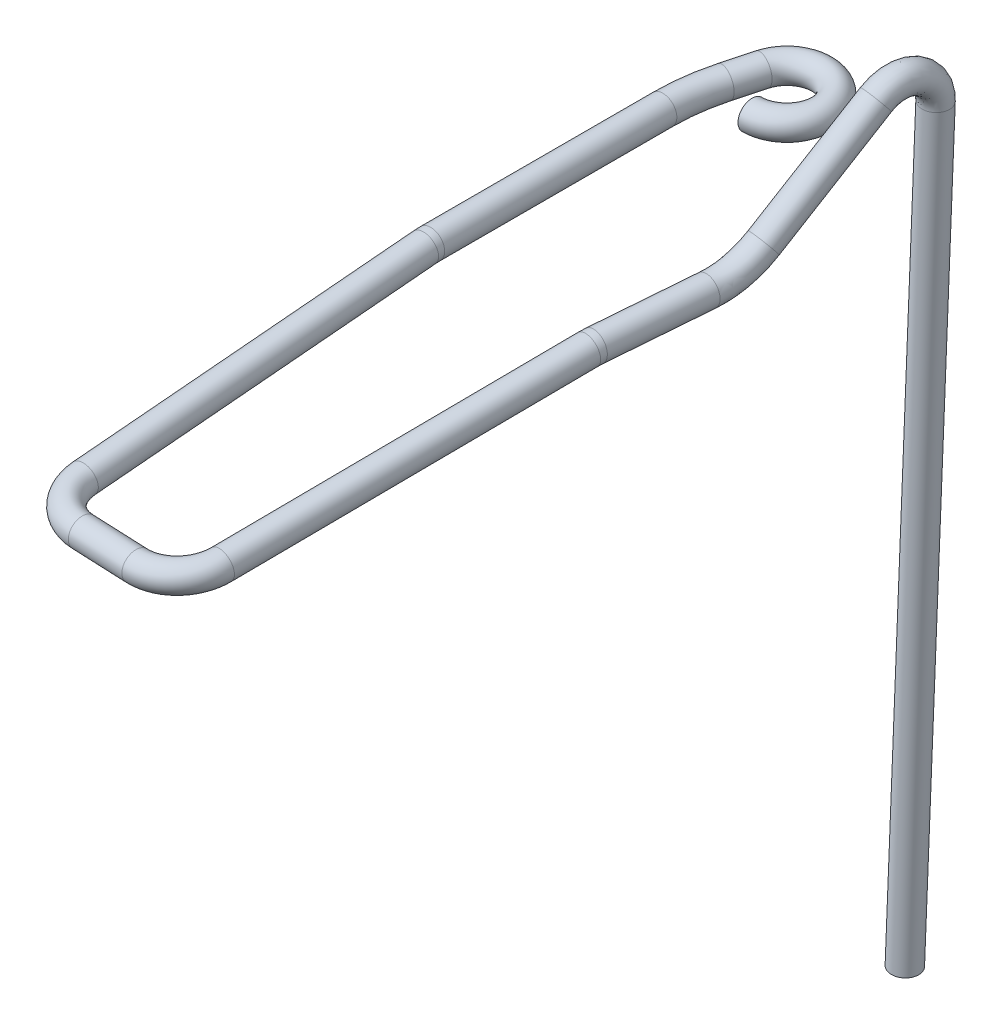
from build123d import *

# Parameters (mm, degrees)
SKETCH4_R  = 1
SKETCH12_R = 1
SKETCH15_R = 1
SKETCH17_R = 1
SKETCH18_R = 1


with BuildPart() as part:
    # Sweep1: sweep along a path in Sketch1
    with BuildLine(Plane(origin=(0, 0, 0), x_dir=(1, 0, 0), z_dir=(0, 1, 0))) as sweep1_path:
        Line((-3.5, -22), (-3.5, -5.377707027))
        ThreePointArc((-3.5, -5.377707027), (-3.371672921, -3.419814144), (-2.988887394, -1.495421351))
        Line((-2.988887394, -1.495421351), (-2.414814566, 0.647047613))
        ThreePointArc((-2.414814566, 0.647047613), (1.983383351, 1.521903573), (0, -2.5))
    # Sketch4 → Sweep1 (sweep)
    with BuildSketch(Plane(origin=(0, 0, 0), x_dir=(0, 0, -1), z_dir=(1, 0, 0))):
        with Locations((-2.5, 0)):
            Circle(SKETCH4_R)
    sweep(path=sweep1_path.line)

    # Sweep3: sweep along a path in Sketch13
    with BuildLine(Plane(origin=(-3.5, 0, 0), x_dir=(0, 0, -1), z_dir=(1, 0, 0))) as sweep3_path:
        Line((-46.800382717, -2.150653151), (-22.435778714, -0.01902651))
        ThreePointArc((-22.435778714, -0.01902651), (-22.218096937, -0.004758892), (-22, 0))
    # Sketch12 → Sweep3 (sweep)
    with BuildSketch(Plane.XY.offset(22)):
        with Locations((-3.5, 0)):
            Circle(SKETCH12_R)
    sweep(path=sweep3_path.line)

    # Sweep4: sweep along a path in Sketch14
    with BuildLine(Plane(origin=(-3.5, -2.150653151, 46.800382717), x_dir=(1, 0, 0), z_dir=(0, -0.9961946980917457, -0.08715574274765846))) as sweep4_path:
        ThreePointArc((0, 0), (0.870924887, 2.162875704), (2.997651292, 3.118687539))
        Line((2.997651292, 3.118687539), (6.994459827, 3.276935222))
        ThreePointArc((6.994459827, 3.276935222), (9.190720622, 2.492412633), (10.231107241, 0.405157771))
    # Sketch15 → Sweep4 (sweep)
    with BuildSketch(Plane(origin=(0, -4.079737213, 46.631609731), x_dir=(1, 0, 0), z_dir=(0, -0.08715574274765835, 0.9961946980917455))):
        with Locations((-3.5, 1.93645285)):
            Circle(SKETCH15_R)
    sweep(path=sweep4_path.line)

    # Sweep5: sweep along a path in Sketch16
    with BuildLine(Plane(origin=(7.603209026, -1.23489811, 36.333254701), x_dir=(0.07935086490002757, -0.0018967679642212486, -0.9968449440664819), z_dir=(0.9968216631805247, -0.006943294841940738, 0.07936222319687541))) as sweep5_path:
        Line((-10.903844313, -0.971774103), (13.4469751, 1.240773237))
        ThreePointArc((13.4469751, 1.240773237), (13.668227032, 1.255937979), (13.889933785, 1.261276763))
        Line((13.889933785, 1.261276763), (21.389920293, 1.275502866))
    # Sketch17 → Sweep5 (sweep)
    with BuildSketch(Plane(origin=(-3.706717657, -4.042345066, 46.204215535), x_dir=(-0.996802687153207, 0.01308999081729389, -0.0788229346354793), z_dir=(0.07966537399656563, 0.08687873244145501, -0.9930284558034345))):
        with Locations((-10.458957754, 2.001025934)):
            Circle(SKETCH17_R)
    sweep(path=sweep5_path.line)

    # Sweep2: sweep along a path in Sketch3
    with BuildLine(Plane(origin=(9.16491107, -2.974077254, 15.189541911), x_dir=(0.07575429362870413, -0.07745247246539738, -0.9941138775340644), z_dir=(-0.9958969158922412, 0.04361938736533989, -0.07928859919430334))) as sweep2_path:
        Line((18.791142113, 45.703836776), (14.527197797, -9.130630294))
        ThreePointArc((14.527197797, -9.130630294), (12.951106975, -11.262806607), (10.344231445, -10.778618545))
        Line((10.344231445, -10.778618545), (3.551994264, -4.544397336))
        ThreePointArc((3.551994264, -4.544397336), (1.886999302, -3.462230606), (-0.040025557, -2.982784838))
    # Sketch18 → Sweep2 (sweep)
    with BuildSketch(Plane(origin=(-1.128626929, 0.024536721, 14.17815798), x_dir=(-0.9968439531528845, -0.0024643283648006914, -0.0793477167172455), z_dir=(0.07935207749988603, -0.0017251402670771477, -0.9968451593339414))):
        with Locations((-10.471095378, -0.050341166)):
            Circle(SKETCH18_R)
    sweep(path=sweep2_path.line)


solid = part.part
